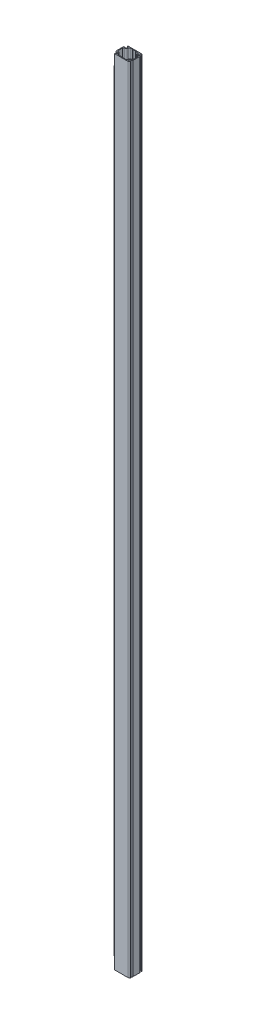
from build123d import *

# Parameters (mm, degrees)
SALIENTE_EXTRUIR1_DEPTH = 4753
CROQUIS2_W              = 12.818220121
CROQUIS2_H              = 10.5
CORTAR_EXTRUIR1_DEPTH   = 70
CROQUIS4_W              = 16.807396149
CROQUIS4_H              = 10.5
CORTAR_EXTRUIR2_DEPTH   = 70


with BuildPart() as part:
    # Croquis1 → Saliente-Extruir1 (new body)
    with BuildSketch(Plane(origin=(0, 0, 0), x_dir=(1, 0, 0), z_dir=(0, 1, 0))):
        with BuildLine():
            Line((39.5, -51.654327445), (-39.5, -51.654327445))
            ThreePointArc((-39.5, -51.654327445), (-45.378848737, -49.854277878), (-49.242036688, -45.071306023))
            ThreePointArc((-49.242036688, -45.071306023), (-48.132501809, -42.469588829), (-45.530784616, -43.579123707))
            ThreePointArc((-45.530784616, -43.579123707), (-33.301534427, -43.111116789), (-43.045454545, -35.706414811))
            ThreePointArc((-43.045454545, -35.706414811), (-47.645290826, -35.890503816), (-50, -31.934782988))
            Line((-50, -31.934782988), (-50, 8.626128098))
            ThreePointArc((-50, 8.626128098), (-47.645290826, 12.581848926), (-43.045454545, 12.397759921))
            ThreePointArc((-43.045454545, 12.397759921), (-33.301534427, 19.8024619), (-45.530784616, 20.270468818))
            ThreePointArc((-45.530784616, 20.270468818), (-48.132501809, 19.16093394), (-49.242036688, 21.762651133))
            ThreePointArc((-49.242036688, 21.762651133), (-45.378848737, 26.545622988), (-39.5, 28.345672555))
            Line((-39.5, 28.345672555), (39.5, 28.345672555))
            ThreePointArc((39.5, 28.345672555), (45.378848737, 26.545622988), (49.242036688, 21.762651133))
            ThreePointArc((49.242036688, 21.762651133), (48.132501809, 19.16093394), (45.530784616, 20.270468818))
            ThreePointArc((45.530784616, 20.270468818), (33.301534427, 19.8024619), (43.045454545, 12.397759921))
            ThreePointArc((43.045454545, 12.397759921), (47.645290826, 12.581848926), (50, 8.626128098))
            Line((50, 8.626128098), (50, -31.934782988))
            ThreePointArc((50, -31.934782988), (47.645290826, -35.890503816), (43.045454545, -35.706414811))
            ThreePointArc((43.045454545, -35.706414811), (33.301534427, -43.111116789), (45.530784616, -43.579123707))
            ThreePointArc((45.530784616, -43.579123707), (48.132501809, -42.469588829), (49.242036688, -45.071306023))
            ThreePointArc((49.242036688, -45.071306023), (45.378848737, -49.854277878), (39.5, -51.654327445))
        make_face()
        with BuildLine():
            Line((22.5, 24.345672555), (12.5, 24.345672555))
            Line((12.5, 24.345672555), (11, 22.845672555))
            Line((11, 22.845672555), (8, 22.845672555))
            Line((8, 22.845672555), (6.5, 24.345672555))
            Line((6.5, 24.345672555), (-6.5, 24.345672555))
            Line((-6.5, 24.345672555), (-8, 22.845672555))
            Line((-8, 22.845672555), (-11, 22.845672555))
            Line((-11, 22.845672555), (-12.5, 24.345672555))
            Line((-12.5, 24.345672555), (-22.5, 24.345672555))
            ThreePointArc((-22.5, 24.345672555), (-27.096194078, 22.441866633), (-29, 17.845672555))
            ThreePointArc((-29, 17.845672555), (-32.075378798, 10.421051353), (-39.5, 7.345672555))
            ThreePointArc((-39.5, 7.345672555), (-44.096194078, 5.441866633), (-46, 0.845672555))
            Line((-46, 0.845672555), (-46, -24.154327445))
            ThreePointArc((-46, -24.154327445), (-44.096194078, -28.750521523), (-39.5, -30.654327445))
            ThreePointArc((-39.5, -30.654327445), (-32.075378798, -33.729706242), (-29, -41.154327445))
            ThreePointArc((-29, -41.154327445), (-27.096194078, -45.750521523), (-22.5, -47.654327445))
            Line((-22.5, -47.654327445), (-12.5, -47.654327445))
            Line((-12.5, -47.654327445), (-11, -46.154327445))
            Line((-11, -46.154327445), (-8, -46.154327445))
            Line((-8, -46.154327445), (-6.5, -47.654327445))
            Line((-6.5, -47.654327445), (6.5, -47.654327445))
            Line((6.5, -47.654327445), (8, -46.154327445))
            Line((8, -46.154327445), (11, -46.154327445))
            Line((11, -46.154327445), (12.5, -47.654327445))
            Line((12.5, -47.654327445), (22.5, -47.654327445))
            ThreePointArc((22.5, -47.654327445), (27.096194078, -45.750521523), (29, -41.154327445))
            ThreePointArc((29, -41.154327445), (32.075378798, -33.729706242), (39.5, -30.654327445))
            ThreePointArc((39.5, -30.654327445), (44.096194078, -28.750521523), (46, -24.154327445))
            Line((46, -24.154327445), (46, 0.845672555))
            ThreePointArc((46, 0.845672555), (44.096194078, 5.441866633), (39.5, 7.345672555))
            ThreePointArc((39.5, 7.345672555), (32.075378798, 10.421051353), (29, 17.845672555))
            ThreePointArc((29, 17.845672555), (27.096194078, 22.441866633), (22.5, 24.345672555))
        make_face(mode=Mode.SUBTRACT)
    extrude(amount=SALIENTE_EXTRUIR1_DEPTH)

    # Croquis2 → Cortar-Extruir1 (cut)
    with BuildSketch(Plane(origin=(0, 4753, 0), x_dir=(1, 0, 0), z_dir=(0, 1, 0))):
        with Locations((-45.90911006, 23.095672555)):
            Rectangle(CROQUIS2_W, CROQUIS2_H)
        with Locations((-45.90911006, -46.404327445)):
            Rectangle(CROQUIS2_W, CROQUIS2_H)
    extrude(amount=-CORTAR_EXTRUIR1_DEPTH, mode=Mode.SUBTRACT)

    # Croquis4 → Cortar-Extruir2 (cut)
    with BuildSketch(Plane(origin=(0, 0, 0), x_dir=(-1, 0, 0), z_dir=(0, -1, 0))):
        with Locations((47.903698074, -46.404327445)):
            Rectangle(CROQUIS4_W, CROQUIS4_H)
        with Locations((47.903698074, 23.095672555)):
            Rectangle(CROQUIS4_W, CROQUIS4_H)
    extrude(amount=-CORTAR_EXTRUIR2_DEPTH, mode=Mode.SUBTRACT)


solid = part.part
